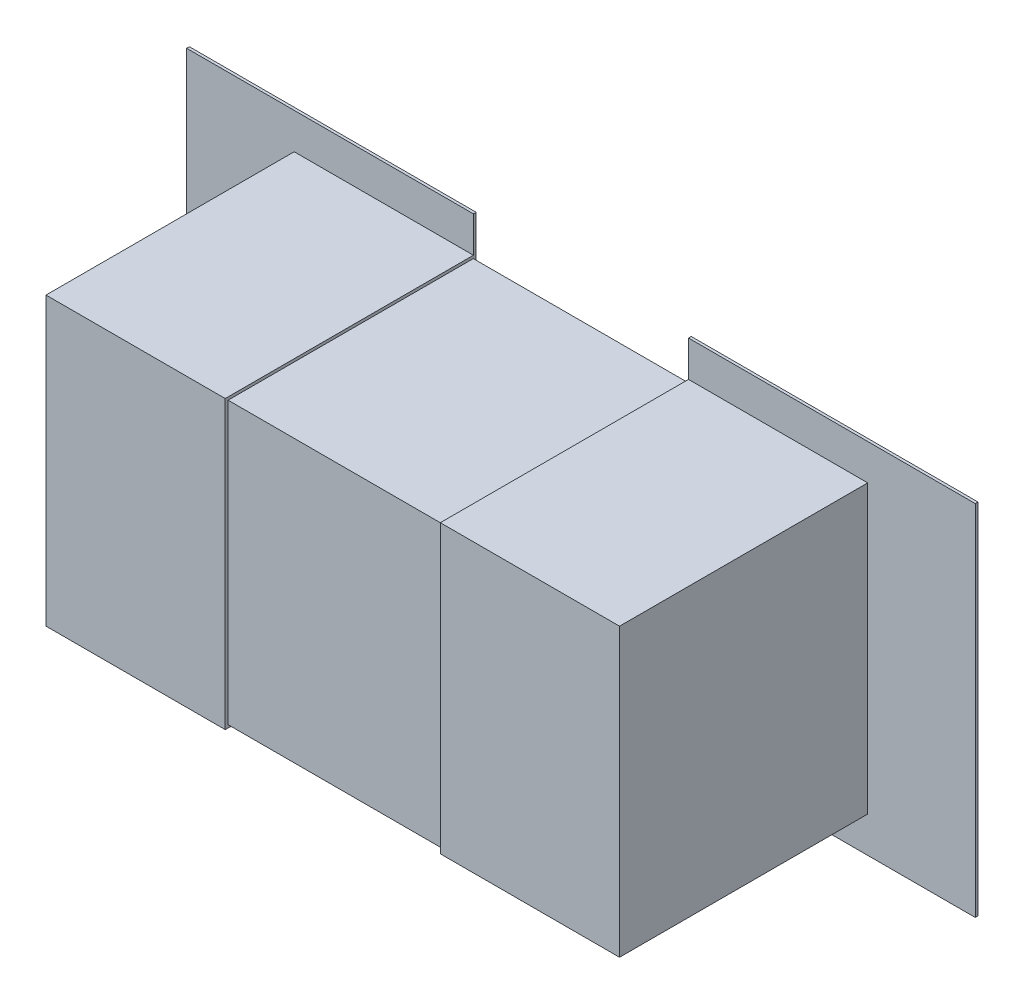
ISO-10303-21;
HEADER;
FILE_DESCRIPTION(('STEP AP214'),'2;1');
FILE_NAME('part.step','',(''),(''),'','','');
FILE_SCHEMA(('AUTOMOTIVE_DESIGN { 1 0 10303 214 1 1 1 1 }'));
ENDSEC;
DATA;
#1=APPLICATION_CONTEXT('core data for automotive mechanical design processes');
#2=APPLICATION_PROTOCOL_DEFINITION('international standard','automotive_design',2000,#1);
#3=PRODUCT_CONTEXT('',#1,'mechanical');
#4=PRODUCT('Part','Part','',(#3));
#5=PRODUCT_RELATED_PRODUCT_CATEGORY('part','',(#4));
#6=PRODUCT_DEFINITION_FORMATION('','',#4);
#7=PRODUCT_DEFINITION_CONTEXT('part definition',#1,'design');
#8=PRODUCT_DEFINITION('design','',#6,#7);
#9=PRODUCT_DEFINITION_SHAPE('','',#8);
#10=(LENGTH_UNIT() NAMED_UNIT(*) SI_UNIT(.MILLI.,.METRE.));
#11=(NAMED_UNIT(*) PLANE_ANGLE_UNIT() SI_UNIT($,.RADIAN.));
#12=(NAMED_UNIT(*) SI_UNIT($,.STERADIAN.) SOLID_ANGLE_UNIT());
#13=UNCERTAINTY_MEASURE_WITH_UNIT(LENGTH_MEASURE(1.E-05),#10,'distance_accuracy_value','');
#14=(GEOMETRIC_REPRESENTATION_CONTEXT(3) GLOBAL_UNCERTAINTY_ASSIGNED_CONTEXT((#13)) GLOBAL_UNIT_ASSIGNED_CONTEXT((#10,
#11,#12)) REPRESENTATION_CONTEXT('',''));
#15=CARTESIAN_POINT('',(0.,0.,0.));
#16=DIRECTION('',(0.,0.,1.));
#17=DIRECTION('',(1.,0.,0.));
#18=AXIS2_PLACEMENT_3D('',#15,#16,#17);
#19=CARTESIAN_POINT('',(0.800000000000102,-0.399999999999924,0.0762));
#20=DIRECTION('',(1.,0.,0.));
#21=DIRECTION('',(0.,0.,-1.));
#22=AXIS2_PLACEMENT_3D('',#19,#20,#21);
#23=PLANE('',#22);
#24=DIRECTION('',(0.,0.,-1.));
#25=VECTOR('',#24,1.);
#26=CARTESIAN_POINT('',(0.800000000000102,-0.399999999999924,0.0762));
#27=LINE('',#26,#25);
#28=CARTESIAN_POINT('',(0.800000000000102,-0.399999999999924,0.08382));
#29=VERTEX_POINT('',#28);
#30=CARTESIAN_POINT('',(0.800000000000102,-0.399999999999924,0.776224));
#31=VERTEX_POINT('',#30);
#32=EDGE_CURVE('E181',#29,#31,#27,.F.);
#33=ORIENTED_EDGE('',*,*,#32,.F.);
#34=DIRECTION('',(0.,1.,0.));
#35=VECTOR('',#34,1.);
#36=CARTESIAN_POINT('',(0.800000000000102,0.,0.08382));
#37=LINE('',#36,#35);
#38=CARTESIAN_POINT('',(0.800000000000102,0.399999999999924,0.08382));
#39=VERTEX_POINT('',#38);
#40=EDGE_CURVE('E191',#39,#29,#37,.F.);
#41=ORIENTED_EDGE('',*,*,#40,.F.);
#42=DIRECTION('',(0.,0.,1.));
#43=VECTOR('',#42,1.);
#44=CARTESIAN_POINT('',(0.800000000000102,0.399999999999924,0.0762));
#45=LINE('',#44,#43);
#46=CARTESIAN_POINT('',(0.800000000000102,0.399999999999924,0.776224));
#47=VERTEX_POINT('',#46);
#48=EDGE_CURVE('E174',#47,#39,#45,.F.);
#49=ORIENTED_EDGE('',*,*,#48,.F.);
#50=DIRECTION('',(0.,1.,0.));
#51=VECTOR('',#50,1.);
#52=CARTESIAN_POINT('',(0.800000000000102,0.,0.776224));
#53=LINE('',#52,#51);
#54=EDGE_CURVE('E149',#31,#47,#53,.T.);
#55=ORIENTED_EDGE('',*,*,#54,.F.);
#56=EDGE_LOOP('',(#33,#41,#49,#55));
#57=FACE_BOUND('',#56,.T.);
#58=ADVANCED_FACE('F16',(#57),#23,.T.);
#59=CARTESIAN_POINT('',(1.09999999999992,-0.500000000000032,0.0762));
#60=DIRECTION('',(1.,0.,0.));
#61=DIRECTION('',(0.,0.,-1.));
#62=AXIS2_PLACEMENT_3D('',#59,#60,#61);
#63=PLANE('',#62);
#64=DIRECTION('',(0.,0.,-1.));
#65=VECTOR('',#64,1.);
#66=CARTESIAN_POINT('',(1.09999999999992,-0.500000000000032,0.0762));
#67=LINE('',#66,#65);
#68=CARTESIAN_POINT('',(1.09999999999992,-0.500000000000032,0.0762));
#69=VERTEX_POINT('',#68);
#70=CARTESIAN_POINT('',(1.09999999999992,-0.500000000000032,0.08382));
#71=VERTEX_POINT('',#70);
#72=EDGE_CURVE('E167',#69,#71,#67,.F.);
#73=ORIENTED_EDGE('',*,*,#72,.F.);
#74=DIRECTION('',(0.,1.,0.));
#75=VECTOR('',#74,1.);
#76=CARTESIAN_POINT('',(1.09999999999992,0.,0.0762));
#77=LINE('',#76,#75);
#78=CARTESIAN_POINT('',(1.09999999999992,0.500000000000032,0.0762));
#79=VERTEX_POINT('',#78);
#80=EDGE_CURVE('E19',#69,#79,#77,.T.);
#81=ORIENTED_EDGE('',*,*,#80,.T.);
#82=DIRECTION('',(0.,0.,1.));
#83=VECTOR('',#82,1.);
#84=CARTESIAN_POINT('',(1.09999999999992,0.500000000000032,0.0762));
#85=LINE('',#84,#83);
#86=CARTESIAN_POINT('',(1.09999999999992,0.500000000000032,0.08382));
#87=VERTEX_POINT('',#86);
#88=EDGE_CURVE('E155',#87,#79,#85,.F.);
#89=ORIENTED_EDGE('',*,*,#88,.F.);
#90=DIRECTION('',(0.,1.,0.));
#91=VECTOR('',#90,1.);
#92=CARTESIAN_POINT('',(1.09999999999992,0.,0.08382));
#93=LINE('',#92,#91);
#94=EDGE_CURVE('E185',#71,#87,#93,.T.);
#95=ORIENTED_EDGE('',*,*,#94,.F.);
#96=EDGE_LOOP('',(#73,#81,#89,#95));
#97=FACE_BOUND('',#96,.T.);
#98=ADVANCED_FACE('F166',(#97),#63,.T.);
#99=CARTESIAN_POINT('',(0.,0.,0.0762));
#100=DIRECTION('',(0.,0.,1.));
#101=DIRECTION('',(1.,0.,0.));
#102=AXIS2_PLACEMENT_3D('',#99,#100,#101);
#103=PLANE('',#102);
#104=ORIENTED_EDGE('',*,*,#80,.F.);
#105=DIRECTION('',(1.,0.,0.));
#106=VECTOR('',#105,1.);
#107=CARTESIAN_POINT('',(0.30000000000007,-0.500000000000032,0.0762));
#108=LINE('',#107,#106);
#109=CARTESIAN_POINT('',(0.30000000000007,-0.500000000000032,0.0762));
#110=VERTEX_POINT('',#109);
#111=EDGE_CURVE('E198',#110,#69,#108,.T.);
#112=ORIENTED_EDGE('',*,*,#111,.F.);
#113=DIRECTION('',(0.,1.,0.));
#114=VECTOR('',#113,1.);
#115=CARTESIAN_POINT('',(0.30000000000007,-0.399999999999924,0.0762));
#116=LINE('',#115,#114);
#117=CARTESIAN_POINT('',(0.30000000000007,0.500000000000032,0.0762));
#118=VERTEX_POINT('',#117);
#119=EDGE_CURVE('E173',#110,#118,#116,.T.);
#120=ORIENTED_EDGE('',*,*,#119,.T.);
#121=DIRECTION('',(1.,0.,0.));
#122=VECTOR('',#121,1.);
#123=CARTESIAN_POINT('',(1.09999999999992,0.500000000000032,0.0762));
#124=LINE('',#123,#122);
#125=EDGE_CURVE('E160',#79,#118,#124,.F.);
#126=ORIENTED_EDGE('',*,*,#125,.F.);
#127=EDGE_LOOP('',(#104,#112,#120,#126));
#128=FACE_BOUND('',#127,.T.);
#129=ADVANCED_FACE('F172',(#128),#103,.F.);
#130=CARTESIAN_POINT('',(1.09999999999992,0.500000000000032,0.0762));
#131=DIRECTION('',(0.,1.,0.));
#132=DIRECTION('',(0.,0.,1.));
#133=AXIS2_PLACEMENT_3D('',#130,#131,#132);
#134=PLANE('',#133);
#135=ORIENTED_EDGE('',*,*,#88,.T.);
#136=ORIENTED_EDGE('',*,*,#125,.T.);
#137=DIRECTION('',(0.,0.,-1.));
#138=VECTOR('',#137,1.);
#139=CARTESIAN_POINT('',(0.30000000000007,0.500000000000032,0.0841999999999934));
#140=LINE('',#139,#138);
#141=CARTESIAN_POINT('',(0.30000000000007,0.500000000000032,0.08382));
#142=VERTEX_POINT('',#141);
#143=EDGE_CURVE('E201',#118,#142,#140,.F.);
#144=ORIENTED_EDGE('',*,*,#143,.T.);
#145=DIRECTION('',(1.,0.,0.));
#146=VECTOR('',#145,1.);
#147=CARTESIAN_POINT('',(0.,0.500000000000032,0.08382));
#148=LINE('',#147,#146);
#149=EDGE_CURVE('E162',#87,#142,#148,.F.);
#150=ORIENTED_EDGE('',*,*,#149,.F.);
#151=EDGE_LOOP('',(#135,#136,#144,#150));
#152=FACE_BOUND('',#151,.T.);
#153=ADVANCED_FACE('F157',(#152),#134,.T.);
#154=CARTESIAN_POINT('',(0.800000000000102,0.399999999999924,0.0762));
#155=DIRECTION('',(0.,1.,0.));
#156=DIRECTION('',(0.,0.,1.));
#157=AXIS2_PLACEMENT_3D('',#154,#155,#156);
#158=PLANE('',#157);
#159=ORIENTED_EDGE('',*,*,#48,.T.);
#160=DIRECTION('',(1.,0.,0.));
#161=VECTOR('',#160,1.);
#162=CARTESIAN_POINT('',(0.,0.399999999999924,0.08382));
#163=LINE('',#162,#161);
#164=CARTESIAN_POINT('',(0.30000000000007,0.399999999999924,0.08382));
#165=VERTEX_POINT('',#164);
#166=EDGE_CURVE('E188',#165,#39,#163,.T.);
#167=ORIENTED_EDGE('',*,*,#166,.F.);
#168=DIRECTION('',(0.,0.,-1.));
#169=VECTOR('',#168,1.);
#170=CARTESIAN_POINT('',(0.30000000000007,0.399999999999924,0.0841999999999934));
#171=LINE('',#170,#169);
#172=CARTESIAN_POINT('',(0.30000000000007,0.399999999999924,0.776224));
#173=VERTEX_POINT('',#172);
#174=EDGE_CURVE('E206',#165,#173,#171,.F.);
#175=ORIENTED_EDGE('',*,*,#174,.T.);
#176=DIRECTION('',(1.,0.,0.));
#177=VECTOR('',#176,1.);
#178=CARTESIAN_POINT('',(0.,0.399999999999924,0.776224));
#179=LINE('',#178,#177);
#180=EDGE_CURVE('E179',#47,#173,#179,.F.);
#181=ORIENTED_EDGE('',*,*,#180,.F.);
#182=EDGE_LOOP('',(#159,#167,#175,#181));
#183=FACE_BOUND('',#182,.T.);
#184=ADVANCED_FACE('F397',(#183),#158,.T.);
#185=CARTESIAN_POINT('',(0.,0.,0.776224));
#186=DIRECTION('',(0.,0.,1.));
#187=DIRECTION('',(1.,0.,0.));
#188=AXIS2_PLACEMENT_3D('',#185,#186,#187);
#189=PLANE('',#188);
#190=ORIENTED_EDGE('',*,*,#180,.T.);
#191=DIRECTION('',(0.,1.,0.));
#192=VECTOR('',#191,1.);
#193=CARTESIAN_POINT('',(0.30000000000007,-0.399999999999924,0.776224));
#194=LINE('',#193,#192);
#195=CARTESIAN_POINT('',(0.30000000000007,-0.399999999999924,0.776224));
#196=VERTEX_POINT('',#195);
#197=EDGE_CURVE('E209',#173,#196,#194,.F.);
#198=ORIENTED_EDGE('',*,*,#197,.T.);
#199=DIRECTION('',(1.,0.,0.));
#200=VECTOR('',#199,1.);
#201=CARTESIAN_POINT('',(-0.800000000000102,-0.399999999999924,0.776224));
#202=LINE('',#201,#200);
#203=EDGE_CURVE('E183',#31,#196,#202,.F.);
#204=ORIENTED_EDGE('',*,*,#203,.F.);
#205=ORIENTED_EDGE('',*,*,#54,.T.);
#206=EDGE_LOOP('',(#190,#198,#204,#205));
#207=FACE_BOUND('',#206,.T.);
#208=ADVANCED_FACE('F393',(#207),#189,.T.);
#209=CARTESIAN_POINT('',(-0.800000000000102,-0.399999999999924,0.0762));
#210=DIRECTION('',(0.,-1.,0.));
#211=DIRECTION('',(0.,0.,-1.));
#212=AXIS2_PLACEMENT_3D('',#209,#210,#211);
#213=PLANE('',#212);
#214=DIRECTION('',(0.,0.,-1.));
#215=VECTOR('',#214,1.);
#216=CARTESIAN_POINT('',(0.30000000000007,-0.399999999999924,0.0841999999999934));
#217=LINE('',#216,#215);
#218=CARTESIAN_POINT('',(0.30000000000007,-0.399999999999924,0.08382));
#219=VERTEX_POINT('',#218);
#220=EDGE_CURVE('E212',#196,#219,#217,.T.);
#221=ORIENTED_EDGE('',*,*,#220,.T.);
#222=DIRECTION('',(1.,0.,0.));
#223=VECTOR('',#222,1.);
#224=CARTESIAN_POINT('',(0.,-0.399999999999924,0.08382));
#225=LINE('',#224,#223);
#226=EDGE_CURVE('E193',#29,#219,#225,.F.);
#227=ORIENTED_EDGE('',*,*,#226,.F.);
#228=ORIENTED_EDGE('',*,*,#32,.T.);
#229=ORIENTED_EDGE('',*,*,#203,.T.);
#230=EDGE_LOOP('',(#221,#227,#228,#229));
#231=FACE_BOUND('',#230,.T.);
#232=ADVANCED_FACE('F389',(#231),#213,.T.);
#233=CARTESIAN_POINT('',(0.,0.,0.08382));
#234=DIRECTION('',(0.,0.,1.));
#235=DIRECTION('',(1.,0.,0.));
#236=AXIS2_PLACEMENT_3D('',#233,#234,#235);
#237=PLANE('',#236);
#238=ORIENTED_EDGE('',*,*,#40,.T.);
#239=ORIENTED_EDGE('',*,*,#226,.T.);
#240=DIRECTION('',(0.,1.,0.));
#241=VECTOR('',#240,1.);
#242=CARTESIAN_POINT('',(0.30000000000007,-0.399999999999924,0.08382));
#243=LINE('',#242,#241);
#244=CARTESIAN_POINT('',(0.30000000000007,-0.500000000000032,0.08382));
#245=VERTEX_POINT('',#244);
#246=EDGE_CURVE('E215',#219,#245,#243,.F.);
#247=ORIENTED_EDGE('',*,*,#246,.T.);
#248=DIRECTION('',(1.,0.,0.));
#249=VECTOR('',#248,1.);
#250=CARTESIAN_POINT('',(0.30000000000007,-0.500000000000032,0.08382));
#251=LINE('',#250,#249);
#252=EDGE_CURVE('E196',#71,#245,#251,.F.);
#253=ORIENTED_EDGE('',*,*,#252,.F.);
#254=ORIENTED_EDGE('',*,*,#94,.T.);
#255=ORIENTED_EDGE('',*,*,#149,.T.);
#256=DIRECTION('',(0.,1.,0.));
#257=VECTOR('',#256,1.);
#258=CARTESIAN_POINT('',(0.30000000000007,-0.399999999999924,0.08382));
#259=LINE('',#258,#257);
#260=EDGE_CURVE('E203',#142,#165,#259,.F.);
#261=ORIENTED_EDGE('',*,*,#260,.T.);
#262=ORIENTED_EDGE('',*,*,#166,.T.);
#263=EDGE_LOOP('',(#238,#239,#247,#253,#254,#255,#261,#262));
#264=FACE_BOUND('',#263,.T.);
#265=ADVANCED_FACE('F385',(#264),#237,.T.);
#266=CARTESIAN_POINT('',(0.30000000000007,-0.500000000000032,0.0762));
#267=DIRECTION('',(0.,-1.,0.));
#268=DIRECTION('',(0.,0.,-1.));
#269=AXIS2_PLACEMENT_3D('',#266,#267,#268);
#270=PLANE('',#269);
#271=DIRECTION('',(0.,0.,-1.));
#272=VECTOR('',#271,1.);
#273=CARTESIAN_POINT('',(0.30000000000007,-0.500000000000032,0.0841999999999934));
#274=LINE('',#273,#272);
#275=EDGE_CURVE('E218',#245,#110,#274,.T.);
#276=ORIENTED_EDGE('',*,*,#275,.T.);
#277=ORIENTED_EDGE('',*,*,#111,.T.);
#278=ORIENTED_EDGE('',*,*,#72,.T.);
#279=ORIENTED_EDGE('',*,*,#252,.T.);
#280=EDGE_LOOP('',(#276,#277,#278,#279));
#281=FACE_BOUND('',#280,.T.);
#282=ADVANCED_FACE('F381',(#281),#270,.T.);
#283=CARTESIAN_POINT('',(0.30000000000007,-0.399999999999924,0.0841999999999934));
#284=DIRECTION('',(1.,0.,0.));
#285=DIRECTION('',(0.,0.,-1.));
#286=AXIS2_PLACEMENT_3D('',#283,#284,#285);
#287=PLANE('',#286);
#288=DIRECTION('',(0.,1.,0.));
#289=VECTOR('',#288,1.);
#290=CARTESIAN_POINT('',(0.30000000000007,0.399999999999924,0.768224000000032));
#291=LINE('',#290,#289);
#292=CARTESIAN_POINT('',(0.30000000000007,0.391999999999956,0.768224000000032));
#293=VERTEX_POINT('',#292);
#294=CARTESIAN_POINT('',(0.30000000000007,-0.391999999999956,0.768224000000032));
#295=VERTEX_POINT('',#294);
#296=EDGE_CURVE('E247',#293,#295,#291,.F.);
#297=ORIENTED_EDGE('',*,*,#296,.T.);
#298=DIRECTION('',(0.,0.,1.));
#299=VECTOR('',#298,1.);
#300=CARTESIAN_POINT('',(0.30000000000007,-0.391999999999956,0.776224));
#301=LINE('',#300,#299);
#302=CARTESIAN_POINT('',(0.30000000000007,-0.391999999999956,0.0841999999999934));
#303=VERTEX_POINT('',#302);
#304=EDGE_CURVE('E232',#295,#303,#301,.F.);
#305=ORIENTED_EDGE('',*,*,#304,.T.);
#306=DIRECTION('',(0.,1.,0.));
#307=VECTOR('',#306,1.);
#308=CARTESIAN_POINT('',(0.30000000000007,-0.399999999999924,0.0841999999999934));
#309=LINE('',#308,#307);
#310=CARTESIAN_POINT('',(0.30000000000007,0.391999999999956,0.0841999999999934));
#311=VERTEX_POINT('',#310);
#312=EDGE_CURVE('E237',#303,#311,#309,.T.);
#313=ORIENTED_EDGE('',*,*,#312,.T.);
#314=DIRECTION('',(0.,0.,-1.));
#315=VECTOR('',#314,1.);
#316=CARTESIAN_POINT('',(0.30000000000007,0.391999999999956,0.0762));
#317=LINE('',#316,#315);
#318=EDGE_CURVE('E242',#311,#293,#317,.F.);
#319=ORIENTED_EDGE('',*,*,#318,.T.);
#320=EDGE_LOOP('',(#297,#305,#313,#319));
#321=FACE_BOUND('',#320,.T.);
#322=ORIENTED_EDGE('',*,*,#246,.F.);
#323=ORIENTED_EDGE('',*,*,#220,.F.);
#324=ORIENTED_EDGE('',*,*,#197,.F.);
#325=ORIENTED_EDGE('',*,*,#174,.F.);
#326=ORIENTED_EDGE('',*,*,#260,.F.);
#327=ORIENTED_EDGE('',*,*,#143,.F.);
#328=ORIENTED_EDGE('',*,*,#119,.F.);
#329=ORIENTED_EDGE('',*,*,#275,.F.);
#330=EDGE_LOOP('',(#322,#323,#324,#325,#326,#327,#328,#329));
#331=FACE_BOUND('',#330,.T.);
#332=ADVANCED_FACE('F377',(#321,#331),#287,.F.);
#333=CARTESIAN_POINT('',(-0.800000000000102,0.399999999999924,0.0762));
#334=DIRECTION('',(-1.,0.,0.));
#335=DIRECTION('',(0.,0.,1.));
#336=AXIS2_PLACEMENT_3D('',#333,#334,#335);
#337=PLANE('',#336);
#338=DIRECTION('',(0.,0.,1.));
#339=VECTOR('',#338,1.);
#340=CARTESIAN_POINT('',(-0.800000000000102,0.399999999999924,0.0762));
#341=LINE('',#340,#339);
#342=CARTESIAN_POINT('',(-0.800000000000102,0.399999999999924,0.08382));
#343=VERTEX_POINT('',#342);
#344=CARTESIAN_POINT('',(-0.800000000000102,0.399999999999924,0.776224));
#345=VERTEX_POINT('',#344);
#346=EDGE_CURVE('E221',#343,#345,#341,.T.);
#347=ORIENTED_EDGE('',*,*,#346,.F.);
#348=DIRECTION('',(0.,1.,0.));
#349=VECTOR('',#348,1.);
#350=CARTESIAN_POINT('',(-0.800000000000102,0.,0.08382));
#351=LINE('',#350,#349);
#352=CARTESIAN_POINT('',(-0.800000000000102,-0.399999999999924,0.08382));
#353=VERTEX_POINT('',#352);
#354=EDGE_CURVE('E258',#353,#343,#351,.T.);
#355=ORIENTED_EDGE('',*,*,#354,.F.);
#356=DIRECTION('',(0.,0.,-1.));
#357=VECTOR('',#356,1.);
#358=CARTESIAN_POINT('',(-0.800000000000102,-0.399999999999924,0.0762));
#359=LINE('',#358,#357);
#360=CARTESIAN_POINT('',(-0.800000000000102,-0.399999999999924,0.776224));
#361=VERTEX_POINT('',#360);
#362=EDGE_CURVE('E223',#361,#353,#359,.T.);
#363=ORIENTED_EDGE('',*,*,#362,.F.);
#364=DIRECTION('',(0.,1.,0.));
#365=VECTOR('',#364,1.);
#366=CARTESIAN_POINT('',(-0.800000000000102,0.,0.776224));
#367=LINE('',#366,#365);
#368=EDGE_CURVE('E228',#345,#361,#367,.F.);
#369=ORIENTED_EDGE('',*,*,#368,.F.);
#370=EDGE_LOOP('',(#347,#355,#363,#369));
#371=FACE_BOUND('',#370,.T.);
#372=ADVANCED_FACE('F373',(#371),#337,.T.);
#373=CARTESIAN_POINT('',(0.800000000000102,0.399999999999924,0.0762));
#374=DIRECTION('',(0.,1.,0.));
#375=DIRECTION('',(0.,0.,1.));
#376=AXIS2_PLACEMENT_3D('',#373,#374,#375);
#377=PLANE('',#376);
#378=DIRECTION('',(0.,0.,1.));
#379=VECTOR('',#378,1.);
#380=CARTESIAN_POINT('',(-0.30000000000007,0.399999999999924,0.0762));
#381=LINE('',#380,#379);
#382=CARTESIAN_POINT('',(-0.30000000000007,0.399999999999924,0.776224));
#383=VERTEX_POINT('',#382);
#384=CARTESIAN_POINT('',(-0.30000000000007,0.399999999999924,0.08382));
#385=VERTEX_POINT('',#384);
#386=EDGE_CURVE('E261',#383,#385,#381,.F.);
#387=ORIENTED_EDGE('',*,*,#386,.T.);
#388=DIRECTION('',(1.,0.,0.));
#389=VECTOR('',#388,1.);
#390=CARTESIAN_POINT('',(0.,0.399999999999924,0.08382));
#391=LINE('',#390,#389);
#392=EDGE_CURVE('E253',#343,#385,#391,.T.);
#393=ORIENTED_EDGE('',*,*,#392,.F.);
#394=ORIENTED_EDGE('',*,*,#346,.T.);
#395=DIRECTION('',(1.,0.,0.));
#396=VECTOR('',#395,1.);
#397=CARTESIAN_POINT('',(0.,0.399999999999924,0.776224));
#398=LINE('',#397,#396);
#399=EDGE_CURVE('E225',#383,#345,#398,.F.);
#400=ORIENTED_EDGE('',*,*,#399,.F.);
#401=EDGE_LOOP('',(#387,#393,#394,#400));
#402=FACE_BOUND('',#401,.T.);
#403=ADVANCED_FACE('F369',(#402),#377,.T.);
#404=CARTESIAN_POINT('',(-0.800000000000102,-0.399999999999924,0.0762));
#405=DIRECTION('',(0.,-1.,0.));
#406=DIRECTION('',(0.,0.,-1.));
#407=AXIS2_PLACEMENT_3D('',#404,#405,#406);
#408=PLANE('',#407);
#409=ORIENTED_EDGE('',*,*,#362,.T.);
#410=DIRECTION('',(1.,0.,0.));
#411=VECTOR('',#410,1.);
#412=CARTESIAN_POINT('',(0.,-0.399999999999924,0.08382));
#413=LINE('',#412,#411);
#414=CARTESIAN_POINT('',(-0.30000000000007,-0.399999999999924,0.08382));
#415=VERTEX_POINT('',#414);
#416=EDGE_CURVE('E255',#415,#353,#413,.F.);
#417=ORIENTED_EDGE('',*,*,#416,.F.);
#418=DIRECTION('',(0.,0.,1.));
#419=VECTOR('',#418,1.);
#420=CARTESIAN_POINT('',(-0.30000000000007,-0.399999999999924,0.0762));
#421=LINE('',#420,#419);
#422=CARTESIAN_POINT('',(-0.30000000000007,-0.399999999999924,0.776224));
#423=VERTEX_POINT('',#422);
#424=EDGE_CURVE('E270',#415,#423,#421,.T.);
#425=ORIENTED_EDGE('',*,*,#424,.T.);
#426=DIRECTION('',(1.,0.,0.));
#427=VECTOR('',#426,1.);
#428=CARTESIAN_POINT('',(0.,-0.399999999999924,0.776224));
#429=LINE('',#428,#427);
#430=EDGE_CURVE('E230',#361,#423,#429,.T.);
#431=ORIENTED_EDGE('',*,*,#430,.F.);
#432=EDGE_LOOP('',(#409,#417,#425,#431));
#433=FACE_BOUND('',#432,.T.);
#434=ADVANCED_FACE('F365',(#433),#408,.T.);
#435=CARTESIAN_POINT('',(0.,0.,0.776224));
#436=DIRECTION('',(0.,0.,1.));
#437=DIRECTION('',(1.,0.,0.));
#438=AXIS2_PLACEMENT_3D('',#435,#436,#437);
#439=PLANE('',#438);
#440=ORIENTED_EDGE('',*,*,#430,.T.);
#441=DIRECTION('',(0.,1.,0.));
#442=VECTOR('',#441,1.);
#443=CARTESIAN_POINT('',(-0.30000000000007,-0.399999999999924,0.776224));
#444=LINE('',#443,#442);
#445=EDGE_CURVE('E273',#423,#383,#444,.T.);
#446=ORIENTED_EDGE('',*,*,#445,.T.);
#447=ORIENTED_EDGE('',*,*,#399,.T.);
#448=ORIENTED_EDGE('',*,*,#368,.T.);
#449=EDGE_LOOP('',(#440,#446,#447,#448));
#450=FACE_BOUND('',#449,.T.);
#451=ADVANCED_FACE('F361',(#450),#439,.T.);
#452=CARTESIAN_POINT('',(-0.30000000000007,-0.391999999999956,0.776224));
#453=DIRECTION('',(0.,1.,0.));
#454=DIRECTION('',(0.,0.,1.));
#455=AXIS2_PLACEMENT_3D('',#452,#453,#454);
#456=PLANE('',#455);
#457=DIRECTION('',(1.,0.,0.));
#458=VECTOR('',#457,1.);
#459=CARTESIAN_POINT('',(-0.30000000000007,-0.391999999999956,0.0841999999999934));
#460=LINE('',#459,#458);
#461=CARTESIAN_POINT('',(-0.30000000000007,-0.391999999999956,0.0841999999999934));
#462=VERTEX_POINT('',#461);
#463=EDGE_CURVE('E234',#462,#303,#460,.T.);
#464=ORIENTED_EDGE('',*,*,#463,.T.);
#465=ORIENTED_EDGE('',*,*,#304,.F.);
#466=DIRECTION('',(-1.,0.,0.));
#467=VECTOR('',#466,1.);
#468=CARTESIAN_POINT('',(-0.30000000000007,-0.391999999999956,0.768224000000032));
#469=LINE('',#468,#467);
#470=CARTESIAN_POINT('',(-0.30000000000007,-0.391999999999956,0.768224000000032));
#471=VERTEX_POINT('',#470);
#472=EDGE_CURVE('E250',#295,#471,#469,.T.);
#473=ORIENTED_EDGE('',*,*,#472,.T.);
#474=DIRECTION('',(0.,0.,1.));
#475=VECTOR('',#474,1.);
#476=CARTESIAN_POINT('',(-0.30000000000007,-0.391999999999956,0.0762));
#477=LINE('',#476,#475);
#478=EDGE_CURVE('E276',#471,#462,#477,.F.);
#479=ORIENTED_EDGE('',*,*,#478,.T.);
#480=EDGE_LOOP('',(#464,#465,#473,#479));
#481=FACE_BOUND('',#480,.T.);
#482=ADVANCED_FACE('F357',(#481),#456,.F.);
#483=CARTESIAN_POINT('',(-0.30000000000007,-0.399999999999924,0.0841999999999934));
#484=DIRECTION('',(0.,0.,1.));
#485=DIRECTION('',(1.,0.,0.));
#486=AXIS2_PLACEMENT_3D('',#483,#484,#485);
#487=PLANE('',#486);
#488=DIRECTION('',(1.,0.,0.));
#489=VECTOR('',#488,1.);
#490=CARTESIAN_POINT('',(-0.30000000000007,0.391999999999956,0.0841999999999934));
#491=LINE('',#490,#489);
#492=CARTESIAN_POINT('',(-0.30000000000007,0.391999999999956,0.0841999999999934));
#493=VERTEX_POINT('',#492);
#494=EDGE_CURVE('E239',#493,#311,#491,.T.);
#495=ORIENTED_EDGE('',*,*,#494,.T.);
#496=ORIENTED_EDGE('',*,*,#312,.F.);
#497=ORIENTED_EDGE('',*,*,#463,.F.);
#498=DIRECTION('',(0.,1.,0.));
#499=VECTOR('',#498,1.);
#500=CARTESIAN_POINT('',(-0.30000000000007,-0.399999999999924,0.0841999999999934));
#501=LINE('',#500,#499);
#502=EDGE_CURVE('E279',#462,#493,#501,.T.);
#503=ORIENTED_EDGE('',*,*,#502,.T.);
#504=EDGE_LOOP('',(#495,#496,#497,#503));
#505=FACE_BOUND('',#504,.T.);
#506=ADVANCED_FACE('F353',(#505),#487,.F.);
#507=CARTESIAN_POINT('',(-0.30000000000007,0.391999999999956,0.0762));
#508=DIRECTION('',(0.,-1.,0.));
#509=DIRECTION('',(0.,0.,-1.));
#510=AXIS2_PLACEMENT_3D('',#507,#508,#509);
#511=PLANE('',#510);
#512=DIRECTION('',(-1.,0.,0.));
#513=VECTOR('',#512,1.);
#514=CARTESIAN_POINT('',(-0.30000000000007,0.391999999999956,0.768224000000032));
#515=LINE('',#514,#513);
#516=CARTESIAN_POINT('',(-0.30000000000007,0.391999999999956,0.768224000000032));
#517=VERTEX_POINT('',#516);
#518=EDGE_CURVE('E244',#517,#293,#515,.F.);
#519=ORIENTED_EDGE('',*,*,#518,.T.);
#520=ORIENTED_EDGE('',*,*,#318,.F.);
#521=ORIENTED_EDGE('',*,*,#494,.F.);
#522=DIRECTION('',(0.,0.,1.));
#523=VECTOR('',#522,1.);
#524=CARTESIAN_POINT('',(-0.30000000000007,0.391999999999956,0.0762));
#525=LINE('',#524,#523);
#526=EDGE_CURVE('E282',#493,#517,#525,.T.);
#527=ORIENTED_EDGE('',*,*,#526,.T.);
#528=EDGE_LOOP('',(#519,#520,#521,#527));
#529=FACE_BOUND('',#528,.T.);
#530=ADVANCED_FACE('F349',(#529),#511,.F.);
#531=CARTESIAN_POINT('',(-0.30000000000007,0.399999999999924,0.768224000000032));
#532=DIRECTION('',(0.,0.,-1.));
#533=DIRECTION('',(-1.,0.,0.));
#534=AXIS2_PLACEMENT_3D('',#531,#532,#533);
#535=PLANE('',#534);
#536=ORIENTED_EDGE('',*,*,#472,.F.);
#537=ORIENTED_EDGE('',*,*,#296,.F.);
#538=ORIENTED_EDGE('',*,*,#518,.F.);
#539=DIRECTION('',(0.,1.,0.));
#540=VECTOR('',#539,1.);
#541=CARTESIAN_POINT('',(-0.30000000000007,-0.399999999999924,0.768224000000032));
#542=LINE('',#541,#540);
#543=EDGE_CURVE('E285',#517,#471,#542,.F.);
#544=ORIENTED_EDGE('',*,*,#543,.T.);
#545=EDGE_LOOP('',(#536,#537,#538,#544));
#546=FACE_BOUND('',#545,.T.);
#547=ADVANCED_FACE('F345',(#546),#535,.F.);
#548=CARTESIAN_POINT('',(0.,0.,0.08382));
#549=DIRECTION('',(0.,0.,1.));
#550=DIRECTION('',(1.,0.,0.));
#551=AXIS2_PLACEMENT_3D('',#548,#549,#550);
#552=PLANE('',#551);
#553=ORIENTED_EDGE('',*,*,#416,.T.);
#554=ORIENTED_EDGE('',*,*,#354,.T.);
#555=ORIENTED_EDGE('',*,*,#392,.T.);
#556=DIRECTION('',(0.,1.,0.));
#557=VECTOR('',#556,1.);
#558=CARTESIAN_POINT('',(-0.30000000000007,-0.399999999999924,0.08382));
#559=LINE('',#558,#557);
#560=CARTESIAN_POINT('',(-0.30000000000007,0.500000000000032,0.08382));
#561=VERTEX_POINT('',#560);
#562=EDGE_CURVE('E264',#385,#561,#559,.T.);
#563=ORIENTED_EDGE('',*,*,#562,.T.);
#564=DIRECTION('',(1.,0.,0.));
#565=VECTOR('',#564,1.);
#566=CARTESIAN_POINT('',(-0.30000000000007,0.500000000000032,0.08382));
#567=LINE('',#566,#565);
#568=CARTESIAN_POINT('',(-1.09999999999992,0.500000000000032,0.08382));
#569=VERTEX_POINT('',#568);
#570=EDGE_CURVE('E288',#569,#561,#567,.T.);
#571=ORIENTED_EDGE('',*,*,#570,.F.);
#572=DIRECTION('',(0.,1.,0.));
#573=VECTOR('',#572,1.);
#574=CARTESIAN_POINT('',(-1.09999999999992,0.500000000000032,0.08382));
#575=LINE('',#574,#573);
#576=CARTESIAN_POINT('',(-1.09999999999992,-0.500000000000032,0.08382));
#577=VERTEX_POINT('',#576);
#578=EDGE_CURVE('E292',#577,#569,#575,.T.);
#579=ORIENTED_EDGE('',*,*,#578,.F.);
#580=DIRECTION('',(1.,0.,0.));
#581=VECTOR('',#580,1.);
#582=CARTESIAN_POINT('',(-1.09999999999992,-0.500000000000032,0.08382));
#583=LINE('',#582,#581);
#584=CARTESIAN_POINT('',(-0.30000000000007,-0.500000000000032,0.08382));
#585=VERTEX_POINT('',#584);
#586=EDGE_CURVE('E299',#585,#577,#583,.F.);
#587=ORIENTED_EDGE('',*,*,#586,.F.);
#588=DIRECTION('',(0.,1.,0.));
#589=VECTOR('',#588,1.);
#590=CARTESIAN_POINT('',(-0.30000000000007,-0.399999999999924,0.08382));
#591=LINE('',#590,#589);
#592=EDGE_CURVE('E267',#585,#415,#591,.T.);
#593=ORIENTED_EDGE('',*,*,#592,.T.);
#594=EDGE_LOOP('',(#553,#554,#555,#563,#571,#579,#587,#593));
#595=FACE_BOUND('',#594,.T.);
#596=ADVANCED_FACE('F341',(#595),#552,.T.);
#597=CARTESIAN_POINT('',(-0.30000000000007,-0.399999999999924,0.0762));
#598=DIRECTION('',(-1.,0.,0.));
#599=DIRECTION('',(0.,0.,1.));
#600=AXIS2_PLACEMENT_3D('',#597,#598,#599);
#601=PLANE('',#600);
#602=ORIENTED_EDGE('',*,*,#526,.F.);
#603=ORIENTED_EDGE('',*,*,#502,.F.);
#604=ORIENTED_EDGE('',*,*,#478,.F.);
#605=ORIENTED_EDGE('',*,*,#543,.F.);
#606=EDGE_LOOP('',(#602,#603,#604,#605));
#607=FACE_BOUND('',#606,.T.);
#608=ORIENTED_EDGE('',*,*,#424,.F.);
#609=ORIENTED_EDGE('',*,*,#592,.F.);
#610=DIRECTION('',(0.,0.,-1.));
#611=VECTOR('',#610,1.);
#612=CARTESIAN_POINT('',(-0.30000000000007,-0.500000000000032,0.0762));
#613=LINE('',#612,#611);
#614=CARTESIAN_POINT('',(-0.30000000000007,-0.500000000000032,0.0762));
#615=VERTEX_POINT('',#614);
#616=EDGE_CURVE('E296',#615,#585,#613,.F.);
#617=ORIENTED_EDGE('',*,*,#616,.F.);
#618=DIRECTION('',(0.,1.,0.));
#619=VECTOR('',#618,1.);
#620=CARTESIAN_POINT('',(-0.30000000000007,0.,0.0762));
#621=LINE('',#620,#619);
#622=CARTESIAN_POINT('',(-0.30000000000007,0.500000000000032,0.0762));
#623=VERTEX_POINT('',#622);
#624=EDGE_CURVE('E302',#615,#623,#621,.T.);
#625=ORIENTED_EDGE('',*,*,#624,.T.);
#626=DIRECTION('',(0.,0.,1.));
#627=VECTOR('',#626,1.);
#628=CARTESIAN_POINT('',(-0.30000000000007,0.500000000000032,0.0762));
#629=LINE('',#628,#627);
#630=EDGE_CURVE('E290',#561,#623,#629,.F.);
#631=ORIENTED_EDGE('',*,*,#630,.F.);
#632=ORIENTED_EDGE('',*,*,#562,.F.);
#633=ORIENTED_EDGE('',*,*,#386,.F.);
#634=ORIENTED_EDGE('',*,*,#445,.F.);
#635=EDGE_LOOP('',(#608,#609,#617,#625,#631,#632,#633,#634));
#636=FACE_BOUND('',#635,.T.);
#637=ADVANCED_FACE('F323',(#607,#636),#601,.F.);
#638=CARTESIAN_POINT('',(-0.30000000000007,0.500000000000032,0.0762));
#639=DIRECTION('',(0.,1.,0.));
#640=DIRECTION('',(0.,0.,1.));
#641=AXIS2_PLACEMENT_3D('',#638,#639,#640);
#642=PLANE('',#641);
#643=ORIENTED_EDGE('',*,*,#630,.T.);
#644=DIRECTION('',(1.,0.,0.));
#645=VECTOR('',#644,1.);
#646=CARTESIAN_POINT('',(0.,0.500000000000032,0.0762));
#647=LINE('',#646,#645);
#648=CARTESIAN_POINT('',(-1.09999999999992,0.500000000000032,0.0762));
#649=VERTEX_POINT('',#648);
#650=EDGE_CURVE('E305',#623,#649,#647,.F.);
#651=ORIENTED_EDGE('',*,*,#650,.T.);
#652=DIRECTION('',(0.,0.,1.));
#653=VECTOR('',#652,1.);
#654=CARTESIAN_POINT('',(-1.09999999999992,0.500000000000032,0.0762));
#655=LINE('',#654,#653);
#656=EDGE_CURVE('E294',#569,#649,#655,.F.);
#657=ORIENTED_EDGE('',*,*,#656,.F.);
#658=ORIENTED_EDGE('',*,*,#570,.T.);
#659=EDGE_LOOP('',(#643,#651,#657,#658));
#660=FACE_BOUND('',#659,.T.);
#661=ADVANCED_FACE('F317',(#660),#642,.T.);
#662=CARTESIAN_POINT('',(-1.09999999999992,0.500000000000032,0.0762));
#663=DIRECTION('',(-1.,0.,0.));
#664=DIRECTION('',(0.,0.,1.));
#665=AXIS2_PLACEMENT_3D('',#662,#663,#664);
#666=PLANE('',#665);
#667=ORIENTED_EDGE('',*,*,#656,.T.);
#668=DIRECTION('',(0.,1.,0.));
#669=VECTOR('',#668,1.);
#670=CARTESIAN_POINT('',(-1.09999999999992,0.,0.0762));
#671=LINE('',#670,#669);
#672=CARTESIAN_POINT('',(-1.09999999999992,-0.500000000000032,0.0762));
#673=VERTEX_POINT('',#672);
#674=EDGE_CURVE('E25',#649,#673,#671,.F.);
#675=ORIENTED_EDGE('',*,*,#674,.T.);
#676=DIRECTION('',(0.,0.,-1.));
#677=VECTOR('',#676,1.);
#678=CARTESIAN_POINT('',(-1.09999999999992,-0.500000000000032,0.0762));
#679=LINE('',#678,#677);
#680=EDGE_CURVE('E33',#577,#673,#679,.T.);
#681=ORIENTED_EDGE('',*,*,#680,.F.);
#682=ORIENTED_EDGE('',*,*,#578,.T.);
#683=EDGE_LOOP('',(#667,#675,#681,#682));
#684=FACE_BOUND('',#683,.T.);
#685=ADVANCED_FACE('F311',(#684),#666,.T.);
#686=CARTESIAN_POINT('',(-1.09999999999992,-0.500000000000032,0.0762));
#687=DIRECTION('',(0.,-1.,0.));
#688=DIRECTION('',(0.,0.,-1.));
#689=AXIS2_PLACEMENT_3D('',#686,#687,#688);
#690=PLANE('',#689);
#691=ORIENTED_EDGE('',*,*,#680,.T.);
#692=DIRECTION('',(1.,0.,0.));
#693=VECTOR('',#692,1.);
#694=CARTESIAN_POINT('',(0.,-0.500000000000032,0.0762));
#695=LINE('',#694,#693);
#696=EDGE_CURVE('E11',#673,#615,#695,.T.);
#697=ORIENTED_EDGE('',*,*,#696,.T.);
#698=ORIENTED_EDGE('',*,*,#616,.T.);
#699=ORIENTED_EDGE('',*,*,#586,.T.);
#700=EDGE_LOOP('',(#691,#697,#698,#699));
#701=FACE_BOUND('',#700,.T.);
#702=ADVANCED_FACE('F326',(#701),#690,.T.);
#703=CARTESIAN_POINT('',(0.,0.,0.0762));
#704=DIRECTION('',(0.,0.,1.));
#705=DIRECTION('',(1.,0.,0.));
#706=AXIS2_PLACEMENT_3D('',#703,#704,#705);
#707=PLANE('',#706);
#708=ORIENTED_EDGE('',*,*,#674,.F.);
#709=ORIENTED_EDGE('',*,*,#650,.F.);
#710=ORIENTED_EDGE('',*,*,#624,.F.);
#711=ORIENTED_EDGE('',*,*,#696,.F.);
#712=EDGE_LOOP('',(#708,#709,#710,#711));
#713=FACE_BOUND('',#712,.T.);
#714=ADVANCED_FACE('F315',(#713),#707,.F.);
#715=CLOSED_SHELL('',(#58,#98,#129,#153,#184,#208,#232,#265,#282,#332,#372,#403,#434,#451,#482,
#506,#530,#547,#596,#637,#661,#685,#702,#714));
#716=MANIFOLD_SOLID_BREP('B1',#715);
#717=ADVANCED_BREP_SHAPE_REPRESENTATION('',(#18,#716),#14);
#718=SHAPE_DEFINITION_REPRESENTATION(#9,#717);
ENDSEC;
END-ISO-10303-21;
